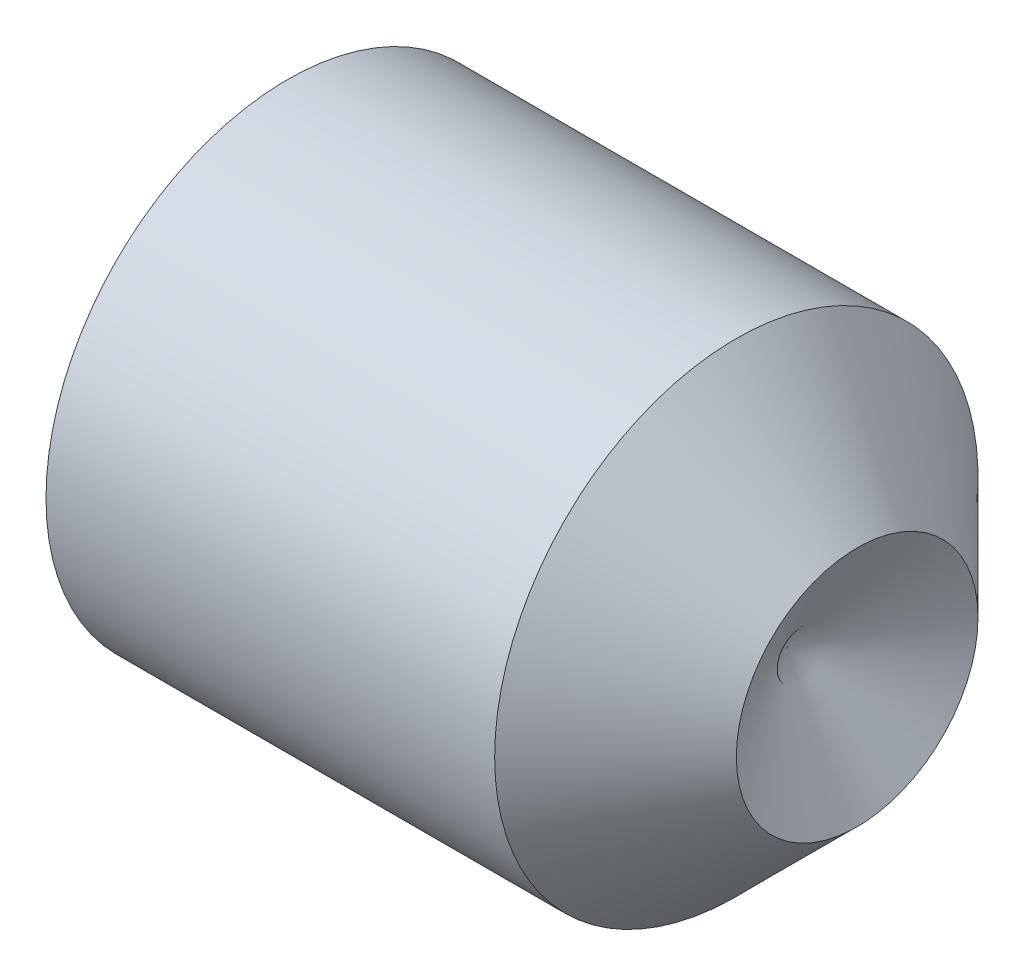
from build123d import *

# Parameters (mm, degrees)
HEXAGONSOCKET_DEPTH = 0.7


with BuildPart() as part:
    # BodySke → BaseBody (revolve)
    with BuildSketch(Plane.XY, mode=Mode.PRIVATE) as basebody_sk:
        Polygon((2, 0), (2, 0.4), (1.6, 0.8), (0, 0.8), (0, 0), align=None)
    revolve(basebody_sk.sketch.rotate(Axis((0, 0, 0), (1, 0, 0)), 90), axis=Axis((0, 0, 0), (1, 0, 0)))

    # HeadChamferSke → HeadChamfer (revolve, cut)
    with BuildSketch(Plane.XY, mode=Mode.PRIVATE) as headchamfer_sk:
        Polygon((0, 0.8), (0, 0.601), (0.114892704, 0.8), align=None)
    revolve(headchamfer_sk.sketch.rotate(Axis((0, 0, 0), (1, 0, 0)), 90), axis=Axis((0, 0, 0), (1, 0, 0)), mode=Mode.SUBTRACT)

    # HexagonSocketSke → HexagonSocket (cut)
    with BuildSketch(Plane.ZY):
        Polygon((0, 0.404145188), (-0.35, 0.202072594), (-0.35, -0.202072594), (0, -0.404145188), (0.35, -0.202072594), (0.35, 0.202072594), align=None)
    extrude(amount=-HEXAGONSOCKET_DEPTH, mode=Mode.SUBTRACT)

    # CupPointSke → CupPoint (revolve, cut)
    with BuildSketch(Plane.XY, mode=Mode.PRIVATE) as cuppoint_sk:
        Polygon((2, 0.4), (2, 0), (1.769059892, 0), align=None)
    revolve(cuppoint_sk.sketch.rotate(Axis((0, 0, 0), (1, 0, 0)), 270), axis=Axis((0, 0, 0), (1, 0, 0)), mode=Mode.SUBTRACT)


solid = part.part
